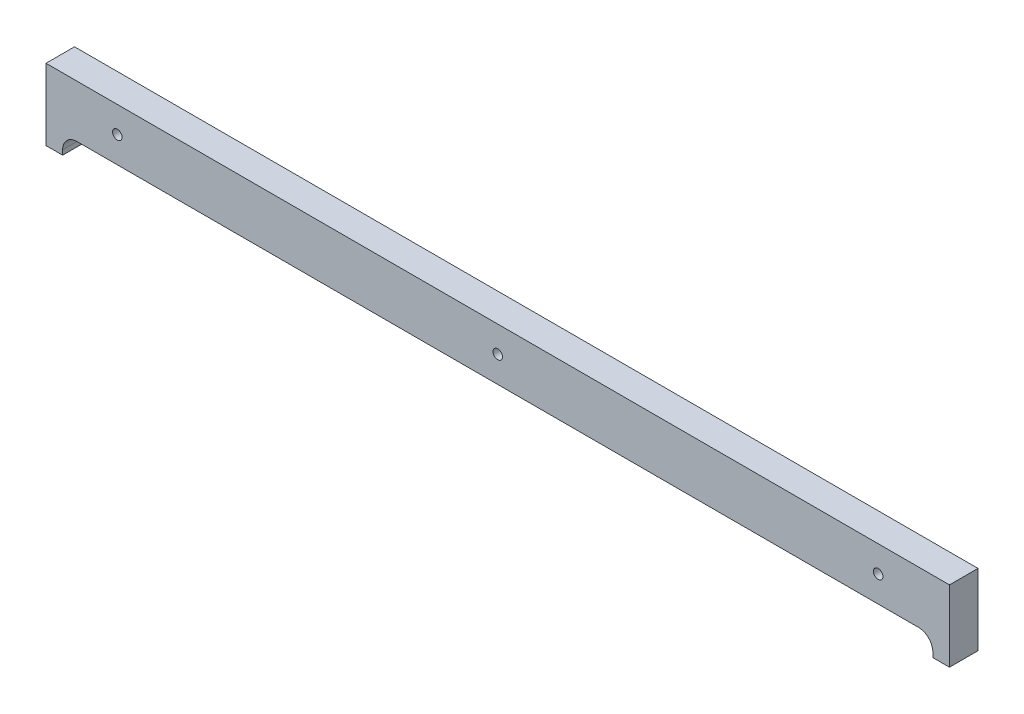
ISO-10303-21;
HEADER;
FILE_DESCRIPTION(('STEP AP214'),'2;1');
FILE_NAME('part.step','',(''),(''),'','','');
FILE_SCHEMA(('AUTOMOTIVE_DESIGN { 1 0 10303 214 1 1 1 1 }'));
ENDSEC;
DATA;
#1=APPLICATION_CONTEXT('core data for automotive mechanical design processes');
#2=APPLICATION_PROTOCOL_DEFINITION('international standard','automotive_design',2000,#1);
#3=PRODUCT_CONTEXT('',#1,'mechanical');
#4=PRODUCT('Part','Part','',(#3));
#5=PRODUCT_RELATED_PRODUCT_CATEGORY('part','',(#4));
#6=PRODUCT_DEFINITION_FORMATION('','',#4);
#7=PRODUCT_DEFINITION_CONTEXT('part definition',#1,'design');
#8=PRODUCT_DEFINITION('design','',#6,#7);
#9=PRODUCT_DEFINITION_SHAPE('','',#8);
#10=(LENGTH_UNIT() NAMED_UNIT(*) SI_UNIT(.MILLI.,.METRE.));
#11=(NAMED_UNIT(*) PLANE_ANGLE_UNIT() SI_UNIT($,.RADIAN.));
#12=(NAMED_UNIT(*) SI_UNIT($,.STERADIAN.) SOLID_ANGLE_UNIT());
#13=UNCERTAINTY_MEASURE_WITH_UNIT(LENGTH_MEASURE(1.E-05),#10,'distance_accuracy_value','');
#14=(GEOMETRIC_REPRESENTATION_CONTEXT(3) GLOBAL_UNCERTAINTY_ASSIGNED_CONTEXT((#13)) GLOBAL_UNIT_ASSIGNED_CONTEXT((#10,
#11,#12)) REPRESENTATION_CONTEXT('',''));
#15=CARTESIAN_POINT('',(0.,0.,0.));
#16=DIRECTION('',(0.,0.,1.));
#17=DIRECTION('',(1.,0.,0.));
#18=AXIS2_PLACEMENT_3D('',#15,#16,#17);
#19=CARTESIAN_POINT('',(0.,0.,6.));
#20=DIRECTION('',(1.,0.,0.));
#21=DIRECTION('',(0.,0.,-1.));
#22=AXIS2_PLACEMENT_3D('',#19,#20,#21);
#23=PLANE('',#22);
#24=DIRECTION('',(0.,-1.,0.));
#25=VECTOR('',#24,1.);
#26=CARTESIAN_POINT('',(0.,0.,0.));
#27=LINE('',#26,#25);
#28=CARTESIAN_POINT('',(0.,15.,0.));
#29=VERTEX_POINT('',#28);
#30=CARTESIAN_POINT('',(0.,0.,0.));
#31=VERTEX_POINT('',#30);
#32=EDGE_CURVE('E157',#29,#31,#27,.T.);
#33=ORIENTED_EDGE('',*,*,#32,.T.);
#34=DIRECTION('',(0.,0.,-1.));
#35=VECTOR('',#34,1.);
#36=CARTESIAN_POINT('',(0.,0.,6.));
#37=LINE('',#36,#35);
#38=CARTESIAN_POINT('',(0.,0.,6.));
#39=VERTEX_POINT('',#38);
#40=EDGE_CURVE('E11',#39,#31,#37,.T.);
#41=ORIENTED_EDGE('',*,*,#40,.F.);
#42=DIRECTION('',(0.,-1.,0.));
#43=VECTOR('',#42,1.);
#44=CARTESIAN_POINT('',(0.,0.,6.));
#45=LINE('',#44,#43);
#46=CARTESIAN_POINT('',(0.,15.,6.));
#47=VERTEX_POINT('',#46);
#48=EDGE_CURVE('E126',#47,#39,#45,.T.);
#49=ORIENTED_EDGE('',*,*,#48,.F.);
#50=DIRECTION('',(0.,0.,-1.));
#51=VECTOR('',#50,1.);
#52=CARTESIAN_POINT('',(0.,15.,6.));
#53=LINE('',#52,#51);
#54=EDGE_CURVE('E136',#47,#29,#53,.T.);
#55=ORIENTED_EDGE('',*,*,#54,.T.);
#56=EDGE_LOOP('',(#33,#41,#49,#55));
#57=FACE_BOUND('',#56,.T.);
#58=ADVANCED_FACE('F26',(#57),#23,.F.);
#59=CARTESIAN_POINT('',(0.,0.,6.));
#60=DIRECTION('',(0.,1.,0.));
#61=DIRECTION('',(0.,0.,1.));
#62=AXIS2_PLACEMENT_3D('',#59,#60,#61);
#63=PLANE('',#62);
#64=DIRECTION('',(1.,0.,0.));
#65=VECTOR('',#64,1.);
#66=CARTESIAN_POINT('',(3.5,0.,2.));
#67=LINE('',#66,#65);
#68=CARTESIAN_POINT('',(3.5,0.,2.));
#69=VERTEX_POINT('',#68);
#70=CARTESIAN_POINT('',(186.5,0.,2.));
#71=VERTEX_POINT('',#70);
#72=EDGE_CURVE('E121',#69,#71,#67,.T.);
#73=ORIENTED_EDGE('',*,*,#72,.F.);
#74=DIRECTION('',(0.,0.,1.));
#75=VECTOR('',#74,1.);
#76=CARTESIAN_POINT('',(3.5,0.,2.));
#77=LINE('',#76,#75);
#78=CARTESIAN_POINT('',(3.5,0.,6.));
#79=VERTEX_POINT('',#78);
#80=EDGE_CURVE('E107',#69,#79,#77,.T.);
#81=ORIENTED_EDGE('',*,*,#80,.T.);
#82=DIRECTION('',(1.,0.,0.));
#83=VECTOR('',#82,1.);
#84=CARTESIAN_POINT('',(0.,0.,6.));
#85=LINE('',#84,#83);
#86=EDGE_CURVE('E119',#39,#79,#85,.T.);
#87=ORIENTED_EDGE('',*,*,#86,.F.);
#88=ORIENTED_EDGE('',*,*,#40,.T.);
#89=DIRECTION('',(1.,0.,0.));
#90=VECTOR('',#89,1.);
#91=CARTESIAN_POINT('',(0.,0.,0.));
#92=LINE('',#91,#90);
#93=CARTESIAN_POINT('',(190.,0.,0.));
#94=VERTEX_POINT('',#93);
#95=EDGE_CURVE('E154',#31,#94,#92,.T.);
#96=ORIENTED_EDGE('',*,*,#95,.T.);
#97=DIRECTION('',(0.,0.,-1.));
#98=VECTOR('',#97,1.);
#99=CARTESIAN_POINT('',(190.,0.,6.));
#100=LINE('',#99,#98);
#101=CARTESIAN_POINT('',(190.,0.,6.));
#102=VERTEX_POINT('',#101);
#103=EDGE_CURVE('E33',#102,#94,#100,.T.);
#104=ORIENTED_EDGE('',*,*,#103,.F.);
#105=CARTESIAN_POINT('',(186.5,0.,6.));
#106=VERTEX_POINT('',#105);
#107=EDGE_CURVE('E129',#106,#102,#85,.T.);
#108=ORIENTED_EDGE('',*,*,#107,.F.);
#109=DIRECTION('',(0.,0.,1.));
#110=VECTOR('',#109,1.);
#111=CARTESIAN_POINT('',(186.5,0.,2.));
#112=LINE('',#111,#110);
#113=EDGE_CURVE('E40',#71,#106,#112,.T.);
#114=ORIENTED_EDGE('',*,*,#113,.F.);
#115=EDGE_LOOP('',(#73,#81,#87,#88,#96,#104,#108,#114));
#116=FACE_BOUND('',#115,.T.);
#117=ADVANCED_FACE('F118',(#116),#63,.F.);
#118=CARTESIAN_POINT('',(190.,0.,6.));
#119=DIRECTION('',(-1.,0.,0.));
#120=DIRECTION('',(0.,0.,1.));
#121=AXIS2_PLACEMENT_3D('',#118,#119,#120);
#122=PLANE('',#121);
#123=DIRECTION('',(0.,1.,0.));
#124=VECTOR('',#123,1.);
#125=CARTESIAN_POINT('',(190.,0.,0.));
#126=LINE('',#125,#124);
#127=CARTESIAN_POINT('',(190.,15.,0.));
#128=VERTEX_POINT('',#127);
#129=EDGE_CURVE('E148',#94,#128,#126,.T.);
#130=ORIENTED_EDGE('',*,*,#129,.T.);
#131=DIRECTION('',(0.,0.,-1.));
#132=VECTOR('',#131,1.);
#133=CARTESIAN_POINT('',(190.,15.,6.));
#134=LINE('',#133,#132);
#135=CARTESIAN_POINT('',(190.,15.,6.));
#136=VERTEX_POINT('',#135);
#137=EDGE_CURVE('E139',#136,#128,#134,.T.);
#138=ORIENTED_EDGE('',*,*,#137,.F.);
#139=DIRECTION('',(0.,1.,0.));
#140=VECTOR('',#139,1.);
#141=CARTESIAN_POINT('',(190.,0.,6.));
#142=LINE('',#141,#140);
#143=EDGE_CURVE('E128',#102,#136,#142,.T.);
#144=ORIENTED_EDGE('',*,*,#143,.F.);
#145=ORIENTED_EDGE('',*,*,#103,.T.);
#146=EDGE_LOOP('',(#130,#138,#144,#145));
#147=FACE_BOUND('',#146,.T.);
#148=ADVANCED_FACE('F146',(#147),#122,.F.);
#149=CARTESIAN_POINT('',(0.,15.,6.));
#150=DIRECTION('',(0.,-1.,0.));
#151=DIRECTION('',(0.,0.,-1.));
#152=AXIS2_PLACEMENT_3D('',#149,#150,#151);
#153=PLANE('',#152);
#154=DIRECTION('',(-1.,0.,0.));
#155=VECTOR('',#154,1.);
#156=CARTESIAN_POINT('',(0.,15.,0.));
#157=LINE('',#156,#155);
#158=EDGE_CURVE('E155',#128,#29,#157,.T.);
#159=ORIENTED_EDGE('',*,*,#158,.T.);
#160=ORIENTED_EDGE('',*,*,#54,.F.);
#161=DIRECTION('',(-1.,0.,0.));
#162=VECTOR('',#161,1.);
#163=CARTESIAN_POINT('',(0.,15.,6.));
#164=LINE('',#163,#162);
#165=EDGE_CURVE('E48',#136,#47,#164,.T.);
#166=ORIENTED_EDGE('',*,*,#165,.F.);
#167=ORIENTED_EDGE('',*,*,#137,.T.);
#168=EDGE_LOOP('',(#159,#160,#166,#167));
#169=FACE_BOUND('',#168,.T.);
#170=ADVANCED_FACE('F215',(#169),#153,.F.);
#171=CARTESIAN_POINT('',(0.,15.,6.));
#172=DIRECTION('',(0.,0.,-1.));
#173=DIRECTION('',(-1.,0.,0.));
#174=AXIS2_PLACEMENT_3D('',#171,#172,#173);
#175=PLANE('',#174);
#176=CARTESIAN_POINT('',(15.,9.5,6.));
#177=DIRECTION('',(0.,0.,1.));
#178=DIRECTION('',(1.,0.,0.));
#179=AXIS2_PLACEMENT_3D('',#176,#177,#178);
#180=CIRCLE('',#179,1.);
#181=CARTESIAN_POINT('',(16.,9.5,6.));
#182=VERTEX_POINT('',#181);
#183=EDGE_CURVE('E207',#182,#182,#180,.T.);
#184=ORIENTED_EDGE('',*,*,#183,.F.);
#185=EDGE_LOOP('',(#184));
#186=FACE_BOUND('',#185,.T.);
#187=CARTESIAN_POINT('',(175.,9.50000000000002,6.));
#188=DIRECTION('',(0.,0.,1.));
#189=DIRECTION('',(1.,0.,0.));
#190=AXIS2_PLACEMENT_3D('',#187,#188,#189);
#191=CIRCLE('',#190,0.999999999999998);
#192=CARTESIAN_POINT('',(176.,9.50000000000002,6.));
#193=VERTEX_POINT('',#192);
#194=EDGE_CURVE('E201',#193,#193,#191,.T.);
#195=ORIENTED_EDGE('',*,*,#194,.F.);
#196=EDGE_LOOP('',(#195));
#197=FACE_BOUND('',#196,.T.);
#198=CARTESIAN_POINT('',(95.,9.50000000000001,6.));
#199=DIRECTION('',(0.,0.,1.));
#200=DIRECTION('',(1.,0.,0.));
#201=AXIS2_PLACEMENT_3D('',#198,#199,#200);
#202=CIRCLE('',#201,0.999999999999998);
#203=CARTESIAN_POINT('',(96.,9.50000000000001,6.));
#204=VERTEX_POINT('',#203);
#205=EDGE_CURVE('E195',#204,#204,#202,.T.);
#206=ORIENTED_EDGE('',*,*,#205,.F.);
#207=EDGE_LOOP('',(#206));
#208=FACE_BOUND('',#207,.T.);
#209=ORIENTED_EDGE('',*,*,#86,.T.);
#210=DIRECTION('',(0.,-1.,0.));
#211=VECTOR('',#210,1.);
#212=CARTESIAN_POINT('',(3.5,0.,6.));
#213=LINE('',#212,#211);
#214=CARTESIAN_POINT('',(3.5,1.,6.));
#215=VERTEX_POINT('',#214);
#216=EDGE_CURVE('E103',#215,#79,#213,.T.);
#217=ORIENTED_EDGE('',*,*,#216,.F.);
#218=CARTESIAN_POINT('',(6.5,1.,6.));
#219=DIRECTION('',(0.,0.,1.));
#220=DIRECTION('',(1.,0.,0.));
#221=AXIS2_PLACEMENT_3D('',#218,#219,#220);
#222=CIRCLE('',#221,3.);
#223=CARTESIAN_POINT('',(6.5,4.,6.));
#224=VERTEX_POINT('',#223);
#225=EDGE_CURVE('E184',#224,#215,#222,.T.);
#226=ORIENTED_EDGE('',*,*,#225,.F.);
#227=DIRECTION('',(-1.,0.,0.));
#228=VECTOR('',#227,1.);
#229=CARTESIAN_POINT('',(6.5,4.,6.));
#230=LINE('',#229,#228);
#231=CARTESIAN_POINT('',(183.5,4.00000000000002,6.));
#232=VERTEX_POINT('',#231);
#233=EDGE_CURVE('E186',#232,#224,#230,.T.);
#234=ORIENTED_EDGE('',*,*,#233,.F.);
#235=CARTESIAN_POINT('',(183.5,1.00000000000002,6.));
#236=DIRECTION('',(0.,0.,1.));
#237=DIRECTION('',(1.,0.,0.));
#238=AXIS2_PLACEMENT_3D('',#235,#236,#237);
#239=CIRCLE('',#238,3.);
#240=CARTESIAN_POINT('',(186.5,1.00000000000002,6.));
#241=VERTEX_POINT('',#240);
#242=EDGE_CURVE('E189',#241,#232,#239,.T.);
#243=ORIENTED_EDGE('',*,*,#242,.F.);
#244=DIRECTION('',(0.,1.,0.));
#245=VECTOR('',#244,1.);
#246=CARTESIAN_POINT('',(186.5,0.,6.));
#247=LINE('',#246,#245);
#248=EDGE_CURVE('E113',#106,#241,#247,.T.);
#249=ORIENTED_EDGE('',*,*,#248,.F.);
#250=ORIENTED_EDGE('',*,*,#107,.T.);
#251=ORIENTED_EDGE('',*,*,#143,.T.);
#252=ORIENTED_EDGE('',*,*,#165,.T.);
#253=ORIENTED_EDGE('',*,*,#48,.T.);
#254=EDGE_LOOP('',(#209,#217,#226,#234,#243,#249,#250,#251,#252,#253));
#255=FACE_BOUND('',#254,.T.);
#256=ADVANCED_FACE('F124',(#186,#197,#208,#255),#175,.F.);
#257=CARTESIAN_POINT('',(0.,15.,0.));
#258=DIRECTION('',(0.,0.,-1.));
#259=DIRECTION('',(-1.,0.,0.));
#260=AXIS2_PLACEMENT_3D('',#257,#258,#259);
#261=PLANE('',#260);
#262=CARTESIAN_POINT('',(15.,9.5,0.));
#263=DIRECTION('',(0.,0.,1.));
#264=DIRECTION('',(1.,0.,0.));
#265=AXIS2_PLACEMENT_3D('',#262,#263,#264);
#266=CIRCLE('',#265,1.);
#267=CARTESIAN_POINT('',(16.,9.5,0.));
#268=VERTEX_POINT('',#267);
#269=EDGE_CURVE('E204',#268,#268,#266,.T.);
#270=ORIENTED_EDGE('',*,*,#269,.T.);
#271=EDGE_LOOP('',(#270));
#272=FACE_BOUND('',#271,.T.);
#273=CARTESIAN_POINT('',(175.,9.50000000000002,0.));
#274=DIRECTION('',(0.,0.,1.));
#275=DIRECTION('',(1.,0.,0.));
#276=AXIS2_PLACEMENT_3D('',#273,#274,#275);
#277=CIRCLE('',#276,0.999999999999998);
#278=CARTESIAN_POINT('',(176.,9.50000000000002,0.));
#279=VERTEX_POINT('',#278);
#280=EDGE_CURVE('E198',#279,#279,#277,.T.);
#281=ORIENTED_EDGE('',*,*,#280,.T.);
#282=EDGE_LOOP('',(#281));
#283=FACE_BOUND('',#282,.T.);
#284=CARTESIAN_POINT('',(95.,9.50000000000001,0.));
#285=DIRECTION('',(0.,0.,1.));
#286=DIRECTION('',(1.,0.,0.));
#287=AXIS2_PLACEMENT_3D('',#284,#285,#286);
#288=CIRCLE('',#287,0.999999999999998);
#289=CARTESIAN_POINT('',(96.,9.50000000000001,0.));
#290=VERTEX_POINT('',#289);
#291=EDGE_CURVE('E114',#290,#290,#288,.T.);
#292=ORIENTED_EDGE('',*,*,#291,.T.);
#293=EDGE_LOOP('',(#292));
#294=FACE_BOUND('',#293,.T.);
#295=ORIENTED_EDGE('',*,*,#32,.F.);
#296=ORIENTED_EDGE('',*,*,#158,.F.);
#297=ORIENTED_EDGE('',*,*,#129,.F.);
#298=ORIENTED_EDGE('',*,*,#95,.F.);
#299=EDGE_LOOP('',(#295,#296,#297,#298));
#300=FACE_BOUND('',#299,.T.);
#301=ADVANCED_FACE('F153',(#272,#283,#294,#300),#261,.T.);
#302=CARTESIAN_POINT('',(3.5,0.,2.));
#303=DIRECTION('',(-1.,0.,0.));
#304=DIRECTION('',(0.,0.,1.));
#305=AXIS2_PLACEMENT_3D('',#302,#303,#304);
#306=PLANE('',#305);
#307=ORIENTED_EDGE('',*,*,#216,.T.);
#308=ORIENTED_EDGE('',*,*,#80,.F.);
#309=DIRECTION('',(0.,-1.,0.));
#310=VECTOR('',#309,1.);
#311=CARTESIAN_POINT('',(3.5,0.,2.));
#312=LINE('',#311,#310);
#313=CARTESIAN_POINT('',(3.5,1.,2.));
#314=VERTEX_POINT('',#313);
#315=EDGE_CURVE('E182',#314,#69,#312,.T.);
#316=ORIENTED_EDGE('',*,*,#315,.F.);
#317=DIRECTION('',(0.,0.,1.));
#318=VECTOR('',#317,1.);
#319=CARTESIAN_POINT('',(3.5,1.,2.));
#320=LINE('',#319,#318);
#321=EDGE_CURVE('E109',#314,#215,#320,.T.);
#322=ORIENTED_EDGE('',*,*,#321,.T.);
#323=EDGE_LOOP('',(#307,#308,#316,#322));
#324=FACE_BOUND('',#323,.T.);
#325=ADVANCED_FACE('F105',(#324),#306,.F.);
#326=CARTESIAN_POINT('',(6.5,1.,2.));
#327=DIRECTION('',(0.,0.,1.));
#328=DIRECTION('',(1.,0.,0.));
#329=AXIS2_PLACEMENT_3D('',#326,#327,#328);
#330=CYLINDRICAL_SURFACE('',#329,3.);
#331=ORIENTED_EDGE('',*,*,#225,.T.);
#332=ORIENTED_EDGE('',*,*,#321,.F.);
#333=CARTESIAN_POINT('',(6.5,1.,2.));
#334=DIRECTION('',(0.,0.,1.));
#335=DIRECTION('',(1.,0.,0.));
#336=AXIS2_PLACEMENT_3D('',#333,#334,#335);
#337=CIRCLE('',#336,3.);
#338=CARTESIAN_POINT('',(6.5,4.,2.));
#339=VERTEX_POINT('',#338);
#340=EDGE_CURVE('E122',#339,#314,#337,.T.);
#341=ORIENTED_EDGE('',*,*,#340,.F.);
#342=DIRECTION('',(0.,0.,1.));
#343=VECTOR('',#342,1.);
#344=CARTESIAN_POINT('',(6.5,4.,2.));
#345=LINE('',#344,#343);
#346=EDGE_CURVE('E167',#339,#224,#345,.T.);
#347=ORIENTED_EDGE('',*,*,#346,.T.);
#348=EDGE_LOOP('',(#331,#332,#341,#347));
#349=FACE_BOUND('',#348,.T.);
#350=ADVANCED_FACE('F255',(#349),#330,.F.);
#351=CARTESIAN_POINT('',(6.5,4.,2.));
#352=DIRECTION('',(0.,1.,0.));
#353=DIRECTION('',(-1.,0.,0.));
#354=AXIS2_PLACEMENT_3D('',#351,#352,#353);
#355=PLANE('',#354);
#356=ORIENTED_EDGE('',*,*,#233,.T.);
#357=ORIENTED_EDGE('',*,*,#346,.F.);
#358=DIRECTION('',(-1.,0.,0.));
#359=VECTOR('',#358,1.);
#360=CARTESIAN_POINT('',(6.5,4.,2.));
#361=LINE('',#360,#359);
#362=CARTESIAN_POINT('',(183.5,4.00000000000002,2.));
#363=VERTEX_POINT('',#362);
#364=EDGE_CURVE('E172',#363,#339,#361,.T.);
#365=ORIENTED_EDGE('',*,*,#364,.F.);
#366=DIRECTION('',(0.,0.,1.));
#367=VECTOR('',#366,1.);
#368=CARTESIAN_POINT('',(183.5,4.00000000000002,2.));
#369=LINE('',#368,#367);
#370=EDGE_CURVE('E165',#363,#232,#369,.T.);
#371=ORIENTED_EDGE('',*,*,#370,.T.);
#372=EDGE_LOOP('',(#356,#357,#365,#371));
#373=FACE_BOUND('',#372,.T.);
#374=ADVANCED_FACE('F261',(#373),#355,.F.);
#375=CARTESIAN_POINT('',(183.5,1.00000000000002,2.));
#376=DIRECTION('',(0.,0.,1.));
#377=DIRECTION('',(1.,0.,0.));
#378=AXIS2_PLACEMENT_3D('',#375,#376,#377);
#379=CYLINDRICAL_SURFACE('',#378,3.);
#380=ORIENTED_EDGE('',*,*,#242,.T.);
#381=ORIENTED_EDGE('',*,*,#370,.F.);
#382=CARTESIAN_POINT('',(183.5,1.00000000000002,2.));
#383=DIRECTION('',(0.,0.,1.));
#384=DIRECTION('',(1.,0.,0.));
#385=AXIS2_PLACEMENT_3D('',#382,#383,#384);
#386=CIRCLE('',#385,3.);
#387=CARTESIAN_POINT('',(186.5,1.00000000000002,2.));
#388=VERTEX_POINT('',#387);
#389=EDGE_CURVE('E175',#388,#363,#386,.T.);
#390=ORIENTED_EDGE('',*,*,#389,.F.);
#391=DIRECTION('',(0.,0.,1.));
#392=VECTOR('',#391,1.);
#393=CARTESIAN_POINT('',(186.5,1.00000000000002,2.));
#394=LINE('',#393,#392);
#395=EDGE_CURVE('E163',#388,#241,#394,.T.);
#396=ORIENTED_EDGE('',*,*,#395,.T.);
#397=EDGE_LOOP('',(#380,#381,#390,#396));
#398=FACE_BOUND('',#397,.T.);
#399=ADVANCED_FACE('F258',(#398),#379,.F.);
#400=CARTESIAN_POINT('',(186.5,0.,2.));
#401=DIRECTION('',(1.,0.,0.));
#402=DIRECTION('',(0.,0.,-1.));
#403=AXIS2_PLACEMENT_3D('',#400,#401,#402);
#404=PLANE('',#403);
#405=ORIENTED_EDGE('',*,*,#248,.T.);
#406=ORIENTED_EDGE('',*,*,#395,.F.);
#407=DIRECTION('',(0.,1.,0.));
#408=VECTOR('',#407,1.);
#409=CARTESIAN_POINT('',(186.5,0.,2.));
#410=LINE('',#409,#408);
#411=EDGE_CURVE('E178',#71,#388,#410,.T.);
#412=ORIENTED_EDGE('',*,*,#411,.F.);
#413=ORIENTED_EDGE('',*,*,#113,.T.);
#414=EDGE_LOOP('',(#405,#406,#412,#413));
#415=FACE_BOUND('',#414,.T.);
#416=ADVANCED_FACE('F234',(#415),#404,.F.);
#417=CARTESIAN_POINT('',(6.5,1.,2.));
#418=DIRECTION('',(0.,0.,1.));
#419=DIRECTION('',(1.,0.,0.));
#420=AXIS2_PLACEMENT_3D('',#417,#418,#419);
#421=PLANE('',#420);
#422=ORIENTED_EDGE('',*,*,#315,.T.);
#423=ORIENTED_EDGE('',*,*,#72,.T.);
#424=ORIENTED_EDGE('',*,*,#411,.T.);
#425=ORIENTED_EDGE('',*,*,#389,.T.);
#426=ORIENTED_EDGE('',*,*,#364,.T.);
#427=ORIENTED_EDGE('',*,*,#340,.T.);
#428=EDGE_LOOP('',(#422,#423,#424,#425,#426,#427));
#429=FACE_BOUND('',#428,.T.);
#430=ADVANCED_FACE('F224',(#429),#421,.T.);
#431=CARTESIAN_POINT('',(95.,9.50000000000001,0.));
#432=DIRECTION('',(0.,0.,1.));
#433=DIRECTION('',(1.,0.,0.));
#434=AXIS2_PLACEMENT_3D('',#431,#432,#433);
#435=CYLINDRICAL_SURFACE('',#434,0.999999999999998);
#436=ORIENTED_EDGE('',*,*,#291,.F.);
#437=EDGE_LOOP('',(#436));
#438=FACE_BOUND('',#437,.T.);
#439=ORIENTED_EDGE('',*,*,#205,.T.);
#440=EDGE_LOOP('',(#439));
#441=FACE_BOUND('',#440,.T.);
#442=ADVANCED_FACE('F221',(#438,#441),#435,.F.);
#443=CARTESIAN_POINT('',(175.,9.50000000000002,0.));
#444=DIRECTION('',(0.,0.,1.));
#445=DIRECTION('',(1.,0.,0.));
#446=AXIS2_PLACEMENT_3D('',#443,#444,#445);
#447=CYLINDRICAL_SURFACE('',#446,0.999999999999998);
#448=ORIENTED_EDGE('',*,*,#280,.F.);
#449=EDGE_LOOP('',(#448));
#450=FACE_BOUND('',#449,.T.);
#451=ORIENTED_EDGE('',*,*,#194,.T.);
#452=EDGE_LOOP('',(#451));
#453=FACE_BOUND('',#452,.T.);
#454=ADVANCED_FACE('F223',(#450,#453),#447,.F.);
#455=CARTESIAN_POINT('',(15.,9.5,0.));
#456=DIRECTION('',(0.,0.,1.));
#457=DIRECTION('',(1.,0.,0.));
#458=AXIS2_PLACEMENT_3D('',#455,#456,#457);
#459=CYLINDRICAL_SURFACE('',#458,1.);
#460=ORIENTED_EDGE('',*,*,#269,.F.);
#461=EDGE_LOOP('',(#460));
#462=FACE_BOUND('',#461,.T.);
#463=ORIENTED_EDGE('',*,*,#183,.T.);
#464=EDGE_LOOP('',(#463));
#465=FACE_BOUND('',#464,.T.);
#466=ADVANCED_FACE('F211',(#462,#465),#459,.F.);
#467=CLOSED_SHELL('',(#58,#117,#148,#170,#256,#301,#325,#350,#374,#399,#416,#430,#442,#454,#466));
#468=MANIFOLD_SOLID_BREP('B2',#467);
#469=ADVANCED_BREP_SHAPE_REPRESENTATION('',(#18,#468),#14);
#470=SHAPE_DEFINITION_REPRESENTATION(#9,#469);
ENDSEC;
END-ISO-10303-21;
